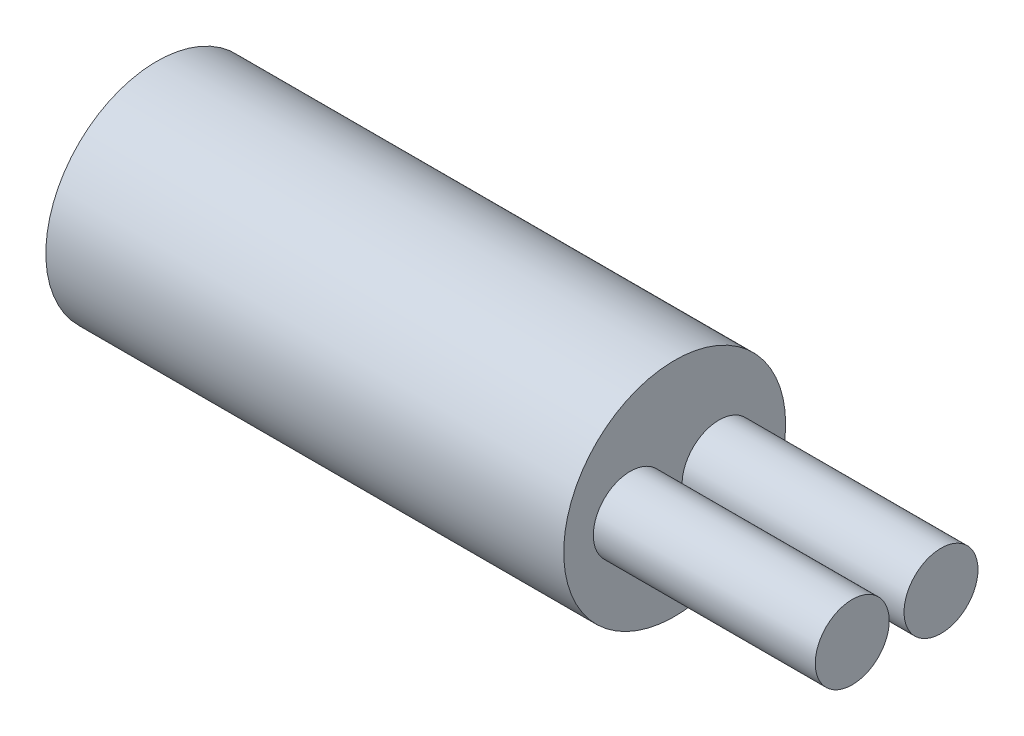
from build123d import *

# Parameters (mm, degrees)
SKIZZE1_R                       = 1.5
AUFSATZ_LINEAR_AUSTRAGEN1_DEPTH = 7
SKIZZE2_R                       = 0.5
AUFSATZ_LINEAR_AUSTRAGEN2_DEPTH = 3


with BuildPart() as part:
    # Skizze1 → Aufsatz-Linear austragen1 (new body)
    with BuildSketch(Plane(origin=(0, 0, 0), x_dir=(0, 0, -1), z_dir=(1, 0, 0))):
        Circle(SKIZZE1_R)
    extrude(amount=-AUFSATZ_LINEAR_AUSTRAGEN1_DEPTH)

    # Skizze2 → Aufsatz-Linear austragen2 (add)
    with BuildSketch(Plane(origin=(0, 0, 0), x_dir=(0, 0, -1), z_dir=(1, 0, 0))):
        with Locations((-0.6, 0)):
            Circle(SKIZZE2_R)
        with Locations((0.6, 0)):
            Circle(SKIZZE2_R)
    extrude(amount=AUFSATZ_LINEAR_AUSTRAGEN2_DEPTH)


solid = part.part
